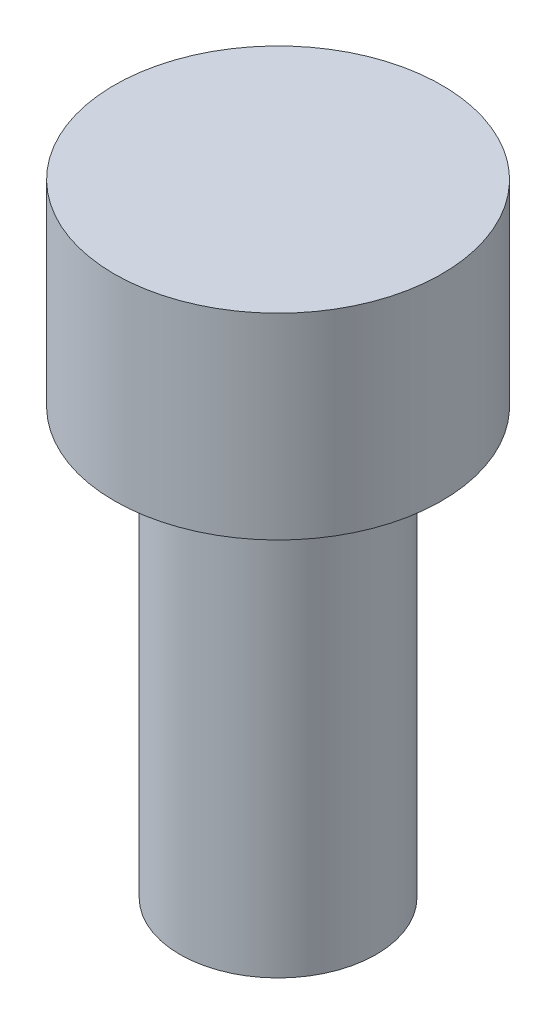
from build123d import *

# Parameters (mm, degrees)
SKETCH_1_R      = 5
EXTRUDE_2_DEPTH = 6
SKETCH_1_3_R    = 3
EXTRUDE_3_DEPTH = 13


with BuildPart() as part:
    # Sketch 1 → Extrude 2 (new body)
    with BuildSketch(Plane(origin=(0, 0, 0), x_dir=(1, 0, 0), z_dir=(0, 1, 0))):
        with Locations(Location((0, 0, 0), (0, 0, 270))):
            Circle(SKETCH_1_R)
    extrude(amount=EXTRUDE_2_DEPTH)

    # Sketch 1_3 → Extrude 3 (add)
    with BuildSketch(Plane(origin=(0, 0, 0), x_dir=(1, 0, 0), z_dir=(0, 1, 0))):
        with Locations(Location((0, 0, 0), (0, 0, 270))):
            Circle(SKETCH_1_3_R)
    extrude(amount=-EXTRUDE_3_DEPTH)


solid = part.part
